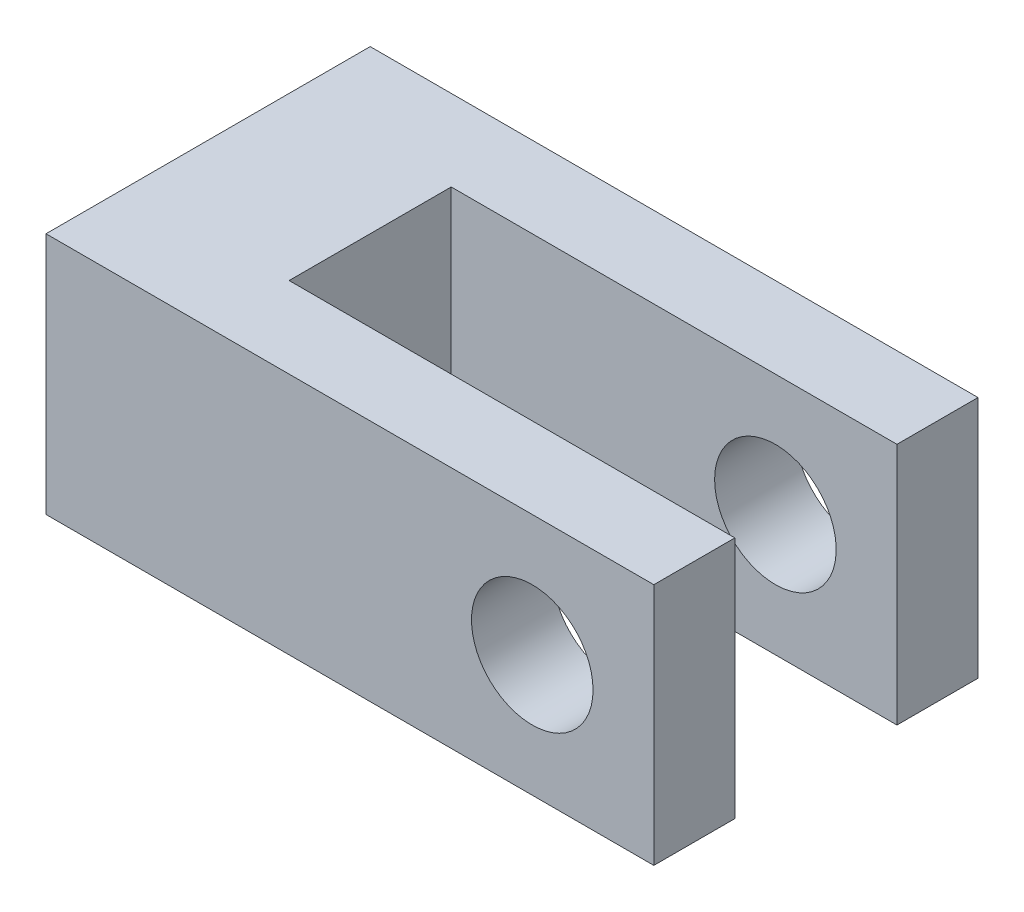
from build123d import *

# Parameters (mm, degrees)
SKETCH1_W           = 47.625
SKETCH1_H           = 19.05
SKETCH1_R           = 4.7625
BOSS_EXTRUDE1_DEPTH = 25.4
SKETCH2_W           = 34.925
SKETCH2_H           = 12.7
CUT_EXTRUDE1_DEPTH  = 50.595085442
SKETCH3_R           = 0.254
CUT_EXTRUDE2_DEPTH  = 55.808997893


with BuildPart() as part:
    # Sketch1 → Boss-Extrude1 (new body)
    with BuildSketch(Plane.XY):
        with Locations((-14.2875, 0)):
            Rectangle(SKETCH1_W, SKETCH1_H)
        Circle(SKETCH1_R, mode=Mode.SUBTRACT)
    extrude(amount=BOSS_EXTRUDE1_DEPTH)

    # Sketch2 → Cut-Extrude1 (cut, through all)
    with BuildSketch(Plane(origin=(0, 9.525, 0), x_dir=(1, 0, 0), z_dir=(0, 1, 0))):
        with Locations((-7.9375, -12.7)):
            Rectangle(SKETCH2_W, SKETCH2_H)
    extrude(amount=-CUT_EXTRUDE1_DEPTH, mode=Mode.SUBTRACT)

    # Sketch3 → Cut-Extrude2 (cut, through all)
    with BuildSketch(Plane.ZY.offset(38.1)):
        with Locations((12.7, 0)):
            Circle(SKETCH3_R)
    extrude(amount=-CUT_EXTRUDE2_DEPTH, mode=Mode.SUBTRACT)


solid = part.part
